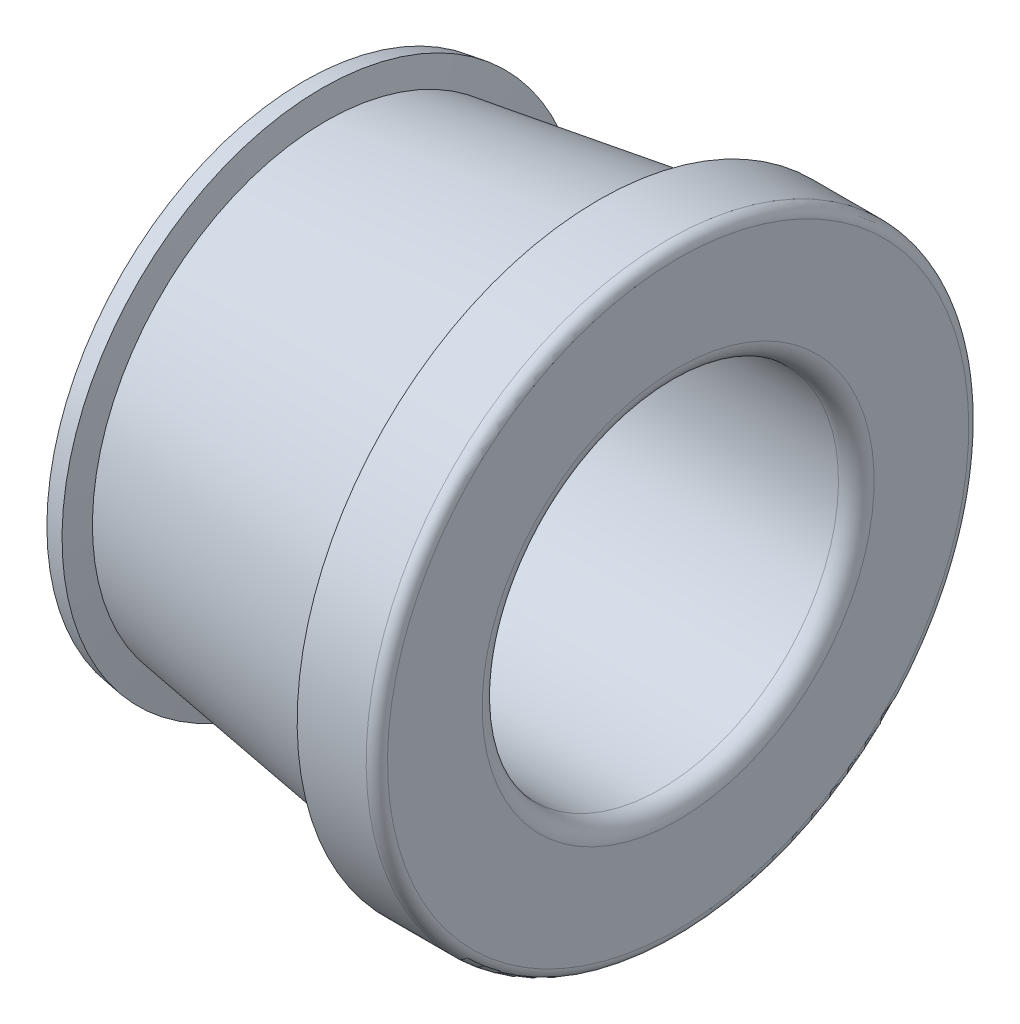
ISO-10303-21;
HEADER;
FILE_DESCRIPTION(('STEP AP214'),'2;1');
FILE_NAME('part.step','',(''),(''),'','','');
FILE_SCHEMA(('AUTOMOTIVE_DESIGN { 1 0 10303 214 1 1 1 1 }'));
ENDSEC;
DATA;
#1=APPLICATION_CONTEXT('core data for automotive mechanical design processes');
#2=APPLICATION_PROTOCOL_DEFINITION('international standard','automotive_design',2000,#1);
#3=PRODUCT_CONTEXT('',#1,'mechanical');
#4=PRODUCT('Part','Part','',(#3));
#5=PRODUCT_RELATED_PRODUCT_CATEGORY('part','',(#4));
#6=PRODUCT_DEFINITION_FORMATION('','',#4);
#7=PRODUCT_DEFINITION_CONTEXT('part definition',#1,'design');
#8=PRODUCT_DEFINITION('design','',#6,#7);
#9=PRODUCT_DEFINITION_SHAPE('','',#8);
#10=(LENGTH_UNIT() NAMED_UNIT(*) SI_UNIT(.MILLI.,.METRE.));
#11=(NAMED_UNIT(*) PLANE_ANGLE_UNIT() SI_UNIT($,.RADIAN.));
#12=(NAMED_UNIT(*) SI_UNIT($,.STERADIAN.) SOLID_ANGLE_UNIT());
#13=UNCERTAINTY_MEASURE_WITH_UNIT(LENGTH_MEASURE(1.E-05),#10,'distance_accuracy_value','');
#14=(GEOMETRIC_REPRESENTATION_CONTEXT(3) GLOBAL_UNCERTAINTY_ASSIGNED_CONTEXT((#13)) GLOBAL_UNIT_ASSIGNED_CONTEXT((#10,
#11,#12)) REPRESENTATION_CONTEXT('',''));
#15=CARTESIAN_POINT('',(0.,0.,0.));
#16=DIRECTION('',(0.,0.,1.));
#17=DIRECTION('',(1.,0.,0.));
#18=AXIS2_PLACEMENT_3D('',#15,#16,#17);
#19=CARTESIAN_POINT('',(7.25,0.,0.));
#20=DIRECTION('',(1.,0.,0.));
#21=DIRECTION('',(0.,1.,0.));
#22=AXIS2_PLACEMENT_3D('',#19,#20,#21);
#23=TOROIDAL_SURFACE('',#22,11.,1.);
#24=CARTESIAN_POINT('',(8.25,0.,0.));
#25=DIRECTION('',(1.,0.,0.));
#26=DIRECTION('',(0.,1.,0.));
#27=AXIS2_PLACEMENT_3D('',#24,#25,#26);
#28=CIRCLE('',#27,11.);
#29=CARTESIAN_POINT('',(8.25,11.,0.));
#30=VERTEX_POINT('',#29);
#31=EDGE_CURVE('E69',#30,#30,#28,.T.);
#32=ORIENTED_EDGE('',*,*,#31,.T.);
#33=EDGE_LOOP('',(#32));
#34=FACE_BOUND('',#33,.T.);
#35=CARTESIAN_POINT('',(7.25,0.,0.));
#36=DIRECTION('',(1.,0.,0.));
#37=DIRECTION('',(0.,1.,0.));
#38=AXIS2_PLACEMENT_3D('',#35,#36,#37);
#39=CIRCLE('',#38,10.);
#40=CARTESIAN_POINT('',(7.25,10.,0.));
#41=VERTEX_POINT('',#40);
#42=EDGE_CURVE('E10',#41,#41,#39,.T.);
#43=ORIENTED_EDGE('',*,*,#42,.F.);
#44=EDGE_LOOP('',(#43));
#45=FACE_BOUND('',#44,.T.);
#46=ADVANCED_FACE('F31',(#34,#45),#23,.T.);
#47=CARTESIAN_POINT('',(8.25,0.,0.));
#48=DIRECTION('',(1.,0.,0.));
#49=DIRECTION('',(0.,1.,0.));
#50=AXIS2_PLACEMENT_3D('',#47,#48,#49);
#51=CYLINDRICAL_SURFACE('',#50,10.);
#52=ORIENTED_EDGE('',*,*,#42,.T.);
#53=EDGE_LOOP('',(#52));
#54=FACE_BOUND('',#53,.T.);
#55=CARTESIAN_POINT('',(-12.15,0.,0.));
#56=DIRECTION('',(1.,0.,0.));
#57=DIRECTION('',(0.,1.,0.));
#58=AXIS2_PLACEMENT_3D('',#55,#56,#57);
#59=CIRCLE('',#58,10.);
#60=CARTESIAN_POINT('',(-12.15,10.,0.));
#61=VERTEX_POINT('',#60);
#62=EDGE_CURVE('E37',#61,#61,#59,.T.);
#63=ORIENTED_EDGE('',*,*,#62,.F.);
#64=EDGE_LOOP('',(#63));
#65=FACE_BOUND('',#64,.T.);
#66=ADVANCED_FACE('F87',(#54,#65),#51,.F.);
#67=CARTESIAN_POINT('',(-12.15,0.,0.));
#68=DIRECTION('',(1.,0.,0.));
#69=DIRECTION('',(0.,1.,0.));
#70=AXIS2_PLACEMENT_3D('',#67,#68,#69);
#71=TOROIDAL_SURFACE('',#70,10.6,0.6);
#72=ORIENTED_EDGE('',*,*,#62,.T.);
#73=EDGE_LOOP('',(#72));
#74=FACE_BOUND('',#73,.T.);
#75=CARTESIAN_POINT('',(-12.75,0.,0.));
#76=DIRECTION('',(1.,0.,0.));
#77=DIRECTION('',(0.,1.,0.));
#78=AXIS2_PLACEMENT_3D('',#75,#76,#77);
#79=CIRCLE('',#78,10.6);
#80=CARTESIAN_POINT('',(-12.75,10.6,0.));
#81=VERTEX_POINT('',#80);
#82=EDGE_CURVE('E41',#81,#81,#79,.T.);
#83=ORIENTED_EDGE('',*,*,#82,.F.);
#84=EDGE_LOOP('',(#83));
#85=FACE_BOUND('',#84,.T.);
#86=ADVANCED_FACE('F91',(#74,#85),#71,.T.);
#87=CARTESIAN_POINT('',(-12.75,10.6,0.));
#88=DIRECTION('',(-1.,0.,0.));
#89=DIRECTION('',(0.,-1.,0.));
#90=AXIS2_PLACEMENT_3D('',#87,#88,#89);
#91=PLANE('',#90);
#92=ORIENTED_EDGE('',*,*,#82,.T.);
#93=EDGE_LOOP('',(#92));
#94=FACE_BOUND('',#93,.T.);
#95=CARTESIAN_POINT('',(-12.75,0.,0.));
#96=DIRECTION('',(1.,0.,0.));
#97=DIRECTION('',(0.,1.,0.));
#98=AXIS2_PLACEMENT_3D('',#95,#96,#97);
#99=CIRCLE('',#98,14.431438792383);
#100=CARTESIAN_POINT('',(-12.75,14.431438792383,0.));
#101=VERTEX_POINT('',#100);
#102=EDGE_CURVE('E45',#101,#101,#99,.T.);
#103=ORIENTED_EDGE('',*,*,#102,.F.);
#104=EDGE_LOOP('',(#103));
#105=FACE_BOUND('',#104,.T.);
#106=ADVANCED_FACE('F95',(#94,#105),#91,.T.);
#107=CARTESIAN_POINT('',(-11.75,0.,0.));
#108=DIRECTION('',(1.,0.,0.));
#109=DIRECTION('',(0.,1.,0.));
#110=AXIS2_PLACEMENT_3D('',#107,#108,#109);
#111=CONICAL_SURFACE('',#110,14.5815071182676,0.148956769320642);
#112=ORIENTED_EDGE('',*,*,#102,.T.);
#113=EDGE_LOOP('',(#112));
#114=FACE_BOUND('',#113,.T.);
#115=CARTESIAN_POINT('',(-11.75,0.,0.));
#116=DIRECTION('',(1.,0.,0.));
#117=DIRECTION('',(0.,1.,0.));
#118=AXIS2_PLACEMENT_3D('',#115,#116,#117);
#119=CIRCLE('',#118,14.5815071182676);
#120=CARTESIAN_POINT('',(-11.75,14.5815071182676,0.));
#121=VERTEX_POINT('',#120);
#122=EDGE_CURVE('E50',#121,#121,#119,.T.);
#123=ORIENTED_EDGE('',*,*,#122,.F.);
#124=EDGE_LOOP('',(#123));
#125=FACE_BOUND('',#124,.T.);
#126=ADVANCED_FACE('F101',(#114,#125),#111,.T.);
#127=CARTESIAN_POINT('',(-11.5273901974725,0.,0.));
#128=DIRECTION('',(-1.,0.,0.));
#129=DIRECTION('',(0.,-1.,0.));
#130=AXIS2_PLACEMENT_3D('',#127,#128,#129);
#131=CONICAL_SURFACE('',#130,13.0981174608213,1.42183955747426);
#132=ORIENTED_EDGE('',*,*,#122,.T.);
#133=EDGE_LOOP('',(#132));
#134=FACE_BOUND('',#133,.T.);
#135=CARTESIAN_POINT('',(-11.5273901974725,0.,0.));
#136=DIRECTION('',(1.,0.,0.));
#137=DIRECTION('',(0.,1.,0.));
#138=AXIS2_PLACEMENT_3D('',#135,#136,#137);
#139=CIRCLE('',#138,13.0981174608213);
#140=CARTESIAN_POINT('',(-11.5273901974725,13.0981174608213,0.));
#141=VERTEX_POINT('',#140);
#142=EDGE_CURVE('E53',#141,#141,#139,.T.);
#143=ORIENTED_EDGE('',*,*,#142,.F.);
#144=EDGE_LOOP('',(#143));
#145=FACE_BOUND('',#144,.T.);
#146=ADVANCED_FACE('F105',(#134,#145),#131,.T.);
#147=CARTESIAN_POINT('',(4.,0.,0.));
#148=DIRECTION('',(1.,0.,0.));
#149=DIRECTION('',(0.,1.,0.));
#150=AXIS2_PLACEMENT_3D('',#147,#148,#149);
#151=CONICAL_SURFACE('',#150,15.4282869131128,0.148956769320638);
#152=ORIENTED_EDGE('',*,*,#142,.T.);
#153=EDGE_LOOP('',(#152));
#154=FACE_BOUND('',#153,.T.);
#155=CARTESIAN_POINT('',(4.,0.,0.));
#156=DIRECTION('',(1.,0.,0.));
#157=DIRECTION('',(0.,1.,0.));
#158=AXIS2_PLACEMENT_3D('',#155,#156,#157);
#159=CIRCLE('',#158,15.4282869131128);
#160=CARTESIAN_POINT('',(4.,15.4282869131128,0.));
#161=VERTEX_POINT('',#160);
#162=EDGE_CURVE('E56',#161,#161,#159,.T.);
#163=ORIENTED_EDGE('',*,*,#162,.F.);
#164=EDGE_LOOP('',(#163));
#165=FACE_BOUND('',#164,.T.);
#166=ADVANCED_FACE('F109',(#154,#165),#151,.T.);
#167=CARTESIAN_POINT('',(3.77739019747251,0.,0.));
#168=DIRECTION('',(-1.,0.,0.));
#169=DIRECTION('',(0.,-1.,0.));
#170=AXIS2_PLACEMENT_3D('',#167,#168,#169);
#171=CONICAL_SURFACE('',#170,16.9116765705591,1.42183955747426);
#172=ORIENTED_EDGE('',*,*,#162,.T.);
#173=EDGE_LOOP('',(#172));
#174=FACE_BOUND('',#173,.T.);
#175=CARTESIAN_POINT('',(3.77739019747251,0.,0.));
#176=DIRECTION('',(1.,0.,0.));
#177=DIRECTION('',(0.,1.,0.));
#178=AXIS2_PLACEMENT_3D('',#175,#176,#177);
#179=CIRCLE('',#178,16.9116765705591);
#180=CARTESIAN_POINT('',(3.77739019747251,16.9116765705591,0.));
#181=VERTEX_POINT('',#180);
#182=EDGE_CURVE('E59',#181,#181,#179,.T.);
#183=ORIENTED_EDGE('',*,*,#182,.F.);
#184=EDGE_LOOP('',(#183));
#185=FACE_BOUND('',#184,.T.);
#186=ADVANCED_FACE('F113',(#174,#185),#171,.F.);
#187=CARTESIAN_POINT('',(8.25,0.,0.));
#188=DIRECTION('',(1.,0.,0.));
#189=DIRECTION('',(0.,1.,0.));
#190=AXIS2_PLACEMENT_3D('',#187,#188,#189);
#191=CYLINDRICAL_SURFACE('',#190,16.9116765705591);
#192=ORIENTED_EDGE('',*,*,#182,.T.);
#193=EDGE_LOOP('',(#192));
#194=FACE_BOUND('',#193,.T.);
#195=CARTESIAN_POINT('',(7.65,0.,0.));
#196=DIRECTION('',(1.,0.,0.));
#197=DIRECTION('',(0.,1.,0.));
#198=AXIS2_PLACEMENT_3D('',#195,#196,#197);
#199=CIRCLE('',#198,16.9116765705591);
#200=CARTESIAN_POINT('',(7.65,16.9116765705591,0.));
#201=VERTEX_POINT('',#200);
#202=EDGE_CURVE('E62',#201,#201,#199,.T.);
#203=ORIENTED_EDGE('',*,*,#202,.F.);
#204=EDGE_LOOP('',(#203));
#205=FACE_BOUND('',#204,.T.);
#206=ADVANCED_FACE('F83',(#194,#205),#191,.T.);
#207=CARTESIAN_POINT('',(7.65,0.,0.));
#208=DIRECTION('',(1.,0.,0.));
#209=DIRECTION('',(0.,1.,0.));
#210=AXIS2_PLACEMENT_3D('',#207,#208,#209);
#211=TOROIDAL_SURFACE('',#210,16.3116765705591,0.6);
#212=ORIENTED_EDGE('',*,*,#202,.T.);
#213=EDGE_LOOP('',(#212));
#214=FACE_BOUND('',#213,.T.);
#215=CARTESIAN_POINT('',(8.25,0.,0.));
#216=DIRECTION('',(1.,0.,0.));
#217=DIRECTION('',(0.,1.,0.));
#218=AXIS2_PLACEMENT_3D('',#215,#216,#217);
#219=CIRCLE('',#218,16.3116765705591);
#220=CARTESIAN_POINT('',(8.25,16.3116765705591,0.));
#221=VERTEX_POINT('',#220);
#222=EDGE_CURVE('E65',#221,#221,#219,.T.);
#223=ORIENTED_EDGE('',*,*,#222,.F.);
#224=EDGE_LOOP('',(#223));
#225=FACE_BOUND('',#224,.T.);
#226=ADVANCED_FACE('F77',(#214,#225),#211,.T.);
#227=CARTESIAN_POINT('',(8.25,11.,0.));
#228=DIRECTION('',(1.,0.,0.));
#229=DIRECTION('',(0.,1.,0.));
#230=AXIS2_PLACEMENT_3D('',#227,#228,#229);
#231=PLANE('',#230);
#232=ORIENTED_EDGE('',*,*,#222,.T.);
#233=EDGE_LOOP('',(#232));
#234=FACE_BOUND('',#233,.T.);
#235=ORIENTED_EDGE('',*,*,#31,.F.);
#236=EDGE_LOOP('',(#235));
#237=FACE_BOUND('',#236,.T.);
#238=ADVANCED_FACE('F75',(#234,#237),#231,.T.);
#239=CLOSED_SHELL('',(#46,#66,#86,#106,#126,#146,#166,#186,#206,#226,#238));
#240=MANIFOLD_SOLID_BREP('B2',#239);
#241=ADVANCED_BREP_SHAPE_REPRESENTATION('',(#18,#240),#14);
#242=SHAPE_DEFINITION_REPRESENTATION(#9,#241);
ENDSEC;
END-ISO-10303-21;
